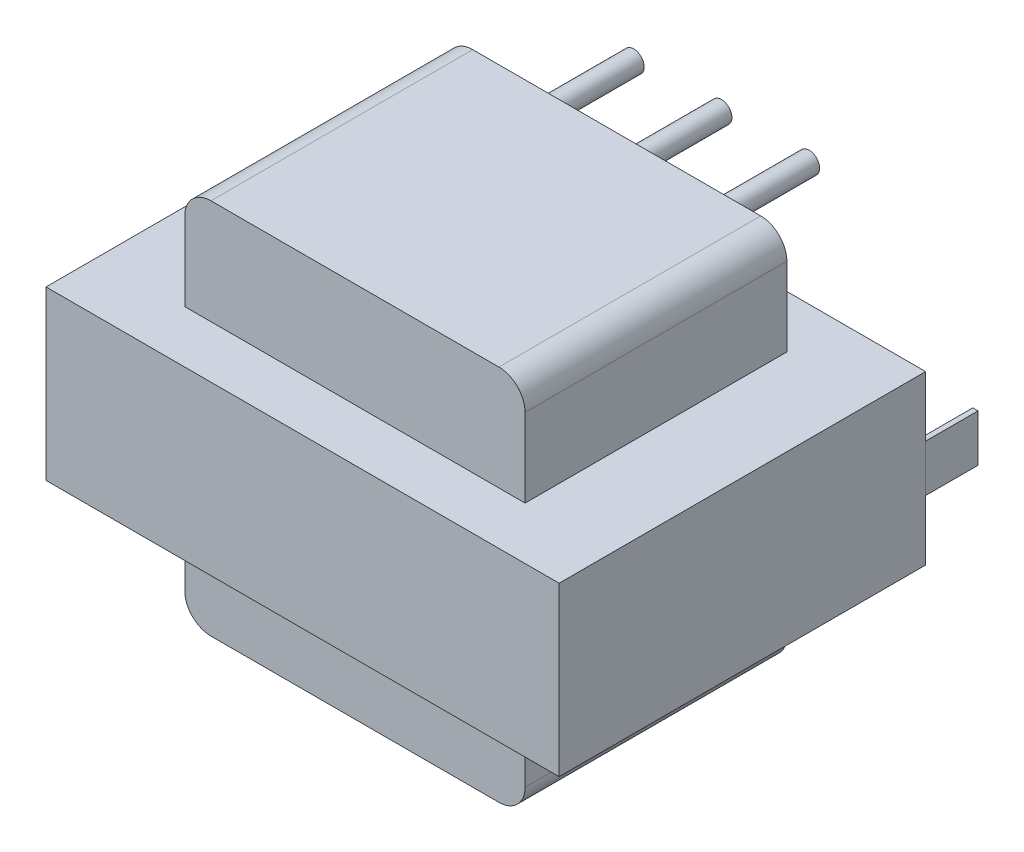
from build123d import *

# Parameters (mm, degrees)
BOSS_EXTRUDE1_DEPTH      = 12.7
SKETCH2_R                = 0.508
BOSS_EXTRUDE2_DEPTH      = 5.08
BOSS_EXTRUDE3_DEPTH      = 2.54
BOSS_EXTRUDE3_DEPTH_BACK = 15.24
SKETCH3_W                = 24.892
SKETCH3_H                = 8.128
SKETCH4_W                = 0.254
SKETCH4_H                = 2.286
BOSS_EXTRUDE4_DEPTH      = 2.54
BOSS_EXTRUDE4_2_DEPTH    = 2.54


with BuildPart() as part:
    # Sketch1 → Boss-Extrude1 (new body)
    with BuildSketch(Plane.XY):
        with BuildLine():
            Line((-6.985, 9.144), (6.985, 9.144))
            ThreePointArc((6.985, 9.144), (7.883025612, 8.772025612), (8.255, 7.874))
            Line((8.255, 7.874), (8.255, -7.874))
            ThreePointArc((8.255, -7.874), (7.883025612, -8.772025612), (6.985, -9.144))
            Line((6.985, -9.144), (-6.985, -9.144))
            ThreePointArc((-6.985, -9.144), (-7.883025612, -8.772025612), (-8.255, -7.874))
            Line((-8.255, -7.874), (-8.255, 7.874))
            ThreePointArc((-8.255, 7.874), (-7.883025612, 8.772025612), (-6.985, 9.144))
        make_face()
    extrude(amount=BOSS_EXTRUDE1_DEPTH)

    # Sketch2 → Boss-Extrude2 (add)
    with BuildSketch(Plane(origin=(0, 0, 0), x_dir=(-1, 0, 0), z_dir=(0, 0, -1))):
        with Locations((4.2545, 7.493)):
            Circle(SKETCH2_R)
        with Locations((0, 7.493)):
            Circle(SKETCH2_R)
        with Locations((-4.2545, 7.493)):
            Circle(SKETCH2_R)
        with Locations((4.2545, -7.493)):
            Circle(SKETCH2_R)
        with Locations((0, -7.493)):
            Circle(SKETCH2_R)
        with Locations((-4.2545, -7.493)):
            Circle(SKETCH2_R)
    extrude(amount=BOSS_EXTRUDE2_DEPTH)


with BuildPart() as body_2:
    # Sketch3 → Boss-Extrude3 (new, two sides: drawn at the far end of the back side and taken through both)
    with BuildSketch(Plane(origin=(0, 0, 0), x_dir=(-1, 0, 0), z_dir=(0, 0, -1)).offset(-BOSS_EXTRUDE3_DEPTH_BACK)):
        Rectangle(SKETCH3_W, SKETCH3_H)
    extrude(amount=BOSS_EXTRUDE3_DEPTH + BOSS_EXTRUDE3_DEPTH_BACK)


with BuildPart() as body_3:
    # Sketch4 → Boss-Extrude4 (new body)
    with BuildSketch(Plane(origin=(0, 0, -2.54), x_dir=(-1, 0, 0), z_dir=(0, 0, -1))):
        with Locations((12.319, 0)):
            Rectangle(SKETCH4_W, SKETCH4_H)
    extrude(amount=BOSS_EXTRUDE4_DEPTH)


with BuildPart() as body_4:
    # Sketch4 → Boss-Extrude4 2 (new body)
    with BuildSketch(Plane(origin=(0, 0, -2.54), x_dir=(-1, 0, 0), z_dir=(0, 0, -1))):
        with Locations((-12.319, 0)):
            Rectangle(SKETCH4_W, SKETCH4_H)
    extrude(amount=BOSS_EXTRUDE4_2_DEPTH)


solid = Compound([part.part, body_2.part, body_3.part, body_4.part])
